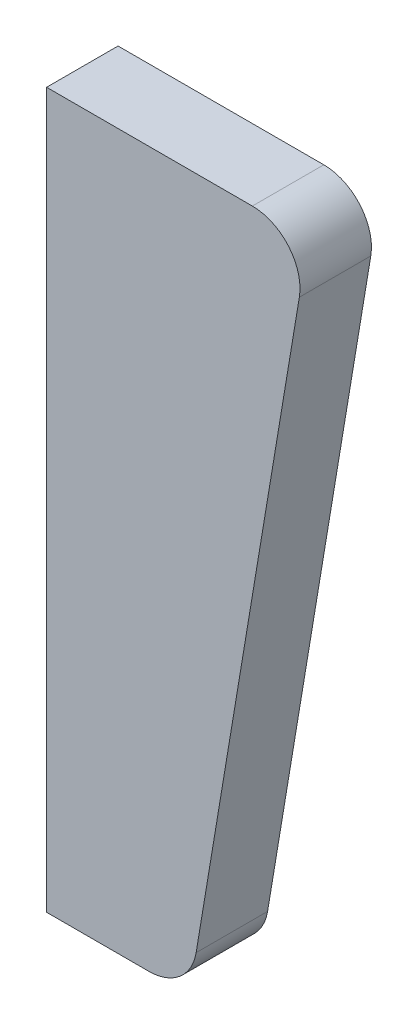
from build123d import *

# Parameters (mm, degrees)
BOSS_EXTRU_1_DEPTH = 3


with BuildPart() as part:
    # Esquisse1 → Boss.-Extru.1 (new body)
    with BuildSketch(Plane.XY):
        with BuildLine():
            Line((-1.554939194, -2.348623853), (2.445060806, -2.348623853))
            Line((2.445060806, -2.348623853), (7.084139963, -2.348623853))
            ThreePointArc((7.084139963, -2.348623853), (8.610179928, -3.055874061), (9.056927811, -4.677421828))
            Line((9.056927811, -4.677421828), (4.723594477, -30.677421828))
            ThreePointArc((4.723594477, -30.677421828), (4.043556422, -31.874663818), (2.75080663, -32.348623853))
            Line((2.75080663, -32.348623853), (-1.554939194, -32.348623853))
            Line((-1.554939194, -32.348623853), (-1.554939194, -2.348623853))
        make_face()
    extrude(amount=BOSS_EXTRU_1_DEPTH)


solid = part.part
